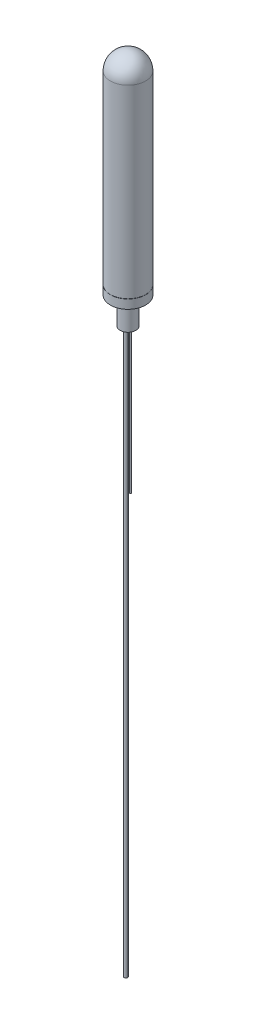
from build123d import *

# Parameters (mm, degrees)
SKETCH2_R           = 1.2446
BOSS_EXTRUDE1_DEPTH = 400
SKETCH3_R           = 0.5969
BOSS_EXTRUDE2_DEPTH = 101.6


with BuildPart() as part:
    # Sketch1 → Revolve1 (revolve)
    with BuildSketch(Plane.XY, mode=Mode.PRIVATE) as revolve1_sk:
        with BuildLine():
            Line((-3.01625, -19), (-5.55625, -19))
            Line((-5.55625, -19), (-5.55625, 0))
            Line((-5.55625, 0), (-12.5, 0))
            Line((-12.5, 0), (-12.5, 6.35))
            Line((-12.5, 6.35), (-12.246, 6.35))
            Line((-12.246, 6.35), (-12.246, 6.477))
            Line((-12.246, 6.477), (-12.5, 6.477))
            Line((-12.5, 6.477), (-12.5, 137.5))
            ThreePointArc((-12.5, 137.5), (-8.838834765, 146.338834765), (0, 150))
            Line((0, 150), (0, 0))
            Line((0, 0), (-3.01625, 0))
            Line((-3.01625, 0), (-3.01625, -19))
        make_face()
    revolve(revolve1_sk.sketch.rotate(Axis((0, 0, 0), (0, 1, 0)), 270), axis=Axis((0, 0, 0), (0, 1, 0)))


with BuildPart() as body_2:
    # Sketch2 → Boss-Extrude1 (new body)
    with BuildSketch(Plane.XZ.offset(19)):
        with Locations(Location((-1.524, 0, 0), (0, 0, 270))):
            Circle(SKETCH2_R)
    extrude(amount=BOSS_EXTRUDE1_DEPTH)


with BuildPart() as body_3:
    # Sketch3 → Boss-Extrude2 (new body)
    with BuildSketch(Plane.XZ.offset(19)):
        with Locations(Location((1.778, 0, 0), (0, 0, 270))):
            Circle(SKETCH3_R)
    extrude(amount=BOSS_EXTRUDE2_DEPTH)


solid = Compound([part.part, body_2.part, body_3.part])
